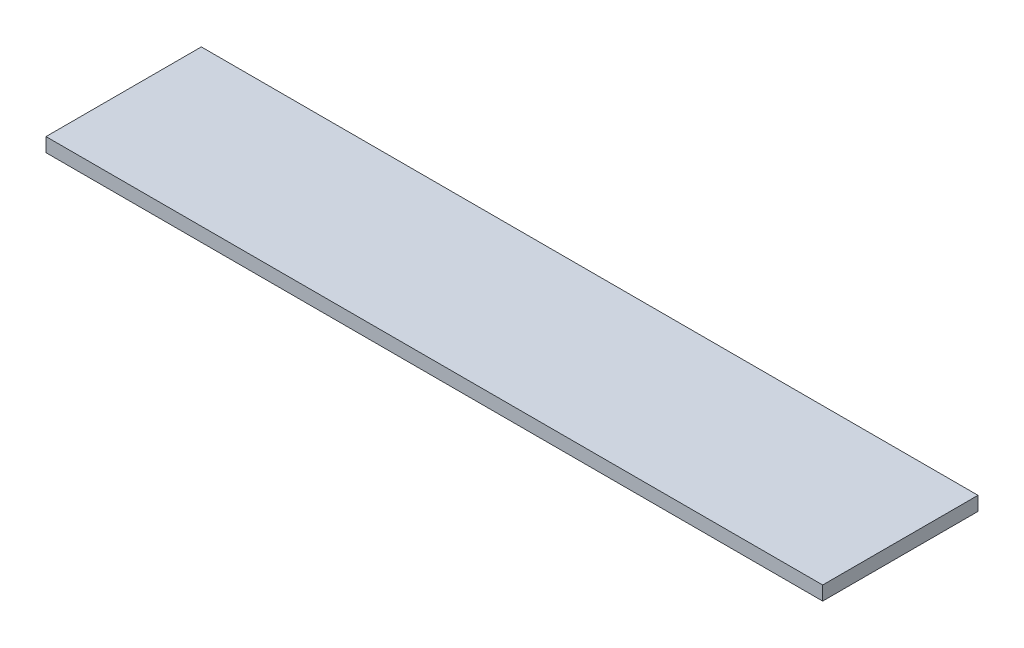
ISO-10303-21;
HEADER;
FILE_DESCRIPTION(('STEP AP214'),'2;1');
FILE_NAME('part.step','',(''),(''),'','','');
FILE_SCHEMA(('AUTOMOTIVE_DESIGN { 1 0 10303 214 1 1 1 1 }'));
ENDSEC;
DATA;
#1=APPLICATION_CONTEXT('core data for automotive mechanical design processes');
#2=APPLICATION_PROTOCOL_DEFINITION('international standard','automotive_design',2000,#1);
#3=PRODUCT_CONTEXT('',#1,'mechanical');
#4=PRODUCT('Part','Part','',(#3));
#5=PRODUCT_RELATED_PRODUCT_CATEGORY('part','',(#4));
#6=PRODUCT_DEFINITION_FORMATION('','',#4);
#7=PRODUCT_DEFINITION_CONTEXT('part definition',#1,'design');
#8=PRODUCT_DEFINITION('design','',#6,#7);
#9=PRODUCT_DEFINITION_SHAPE('','',#8);
#10=(LENGTH_UNIT() NAMED_UNIT(*) SI_UNIT(.MILLI.,.METRE.));
#11=(NAMED_UNIT(*) PLANE_ANGLE_UNIT() SI_UNIT($,.RADIAN.));
#12=(NAMED_UNIT(*) SI_UNIT($,.STERADIAN.) SOLID_ANGLE_UNIT());
#13=UNCERTAINTY_MEASURE_WITH_UNIT(LENGTH_MEASURE(1.E-05),#10,'distance_accuracy_value','');
#14=(GEOMETRIC_REPRESENTATION_CONTEXT(3) GLOBAL_UNCERTAINTY_ASSIGNED_CONTEXT((#13)) GLOBAL_UNIT_ASSIGNED_CONTEXT((#10,
#11,#12)) REPRESENTATION_CONTEXT('',''));
#15=CARTESIAN_POINT('',(0.,0.,0.));
#16=DIRECTION('',(0.,0.,1.));
#17=DIRECTION('',(1.,0.,0.));
#18=AXIS2_PLACEMENT_3D('',#15,#16,#17);
#19=CARTESIAN_POINT('',(-2500.,-45.0000000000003,500.));
#20=DIRECTION('',(1.,0.,0.));
#21=DIRECTION('',(0.,0.,-1.));
#22=AXIS2_PLACEMENT_3D('',#19,#20,#21);
#23=PLANE('',#22);
#24=DIRECTION('',(0.,-1.,0.));
#25=VECTOR('',#24,1.);
#26=CARTESIAN_POINT('',(-2500.,-45.0000000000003,-500.));
#27=LINE('',#26,#25);
#28=CARTESIAN_POINT('',(-2500.,44.9999999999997,-500.));
#29=VERTEX_POINT('',#28);
#30=CARTESIAN_POINT('',(-2500.,-45.0000000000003,-500.));
#31=VERTEX_POINT('',#30);
#32=EDGE_CURVE('E98',#29,#31,#27,.T.);
#33=ORIENTED_EDGE('',*,*,#32,.T.);
#34=DIRECTION('',(0.,0.,-1.));
#35=VECTOR('',#34,1.);
#36=CARTESIAN_POINT('',(-2500.,-45.0000000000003,500.));
#37=LINE('',#36,#35);
#38=CARTESIAN_POINT('',(-2500.,-45.0000000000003,500.));
#39=VERTEX_POINT('',#38);
#40=EDGE_CURVE('E11',#39,#31,#37,.T.);
#41=ORIENTED_EDGE('',*,*,#40,.F.);
#42=DIRECTION('',(0.,-1.,0.));
#43=VECTOR('',#42,1.);
#44=CARTESIAN_POINT('',(-2500.,-45.0000000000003,500.));
#45=LINE('',#44,#43);
#46=CARTESIAN_POINT('',(-2500.,44.9999999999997,500.));
#47=VERTEX_POINT('',#46);
#48=EDGE_CURVE('E86',#47,#39,#45,.T.);
#49=ORIENTED_EDGE('',*,*,#48,.F.);
#50=DIRECTION('',(0.,0.,-1.));
#51=VECTOR('',#50,1.);
#52=CARTESIAN_POINT('',(-2500.,44.9999999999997,500.));
#53=LINE('',#52,#51);
#54=EDGE_CURVE('E94',#47,#29,#53,.T.);
#55=ORIENTED_EDGE('',*,*,#54,.T.);
#56=EDGE_LOOP('',(#33,#41,#49,#55));
#57=FACE_BOUND('',#56,.T.);
#58=ADVANCED_FACE('F35',(#57),#23,.F.);
#59=CARTESIAN_POINT('',(2500.,-44.9999999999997,500.));
#60=DIRECTION('',(0.,1.,0.));
#61=DIRECTION('',(-1.,0.,0.));
#62=AXIS2_PLACEMENT_3D('',#59,#60,#61);
#63=PLANE('',#62);
#64=DIRECTION('',(1.,0.,0.));
#65=VECTOR('',#64,1.);
#66=CARTESIAN_POINT('',(2500.,-44.9999999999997,-500.));
#67=LINE('',#66,#65);
#68=CARTESIAN_POINT('',(2500.,-44.9999999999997,-500.));
#69=VERTEX_POINT('',#68);
#70=EDGE_CURVE('E90',#31,#69,#67,.T.);
#71=ORIENTED_EDGE('',*,*,#70,.T.);
#72=DIRECTION('',(0.,0.,-1.));
#73=VECTOR('',#72,1.);
#74=CARTESIAN_POINT('',(2500.,-44.9999999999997,500.));
#75=LINE('',#74,#73);
#76=CARTESIAN_POINT('',(2500.,-44.9999999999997,500.));
#77=VERTEX_POINT('',#76);
#78=EDGE_CURVE('E43',#77,#69,#75,.T.);
#79=ORIENTED_EDGE('',*,*,#78,.F.);
#80=DIRECTION('',(1.,0.,0.));
#81=VECTOR('',#80,1.);
#82=CARTESIAN_POINT('',(2500.,-44.9999999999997,500.));
#83=LINE('',#82,#81);
#84=EDGE_CURVE('E81',#39,#77,#83,.T.);
#85=ORIENTED_EDGE('',*,*,#84,.F.);
#86=ORIENTED_EDGE('',*,*,#40,.T.);
#87=EDGE_LOOP('',(#71,#79,#85,#86));
#88=FACE_BOUND('',#87,.T.);
#89=ADVANCED_FACE('F89',(#88),#63,.F.);
#90=CARTESIAN_POINT('',(2500.,-44.9999999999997,500.));
#91=DIRECTION('',(-1.,0.,0.));
#92=DIRECTION('',(0.,0.,1.));
#93=AXIS2_PLACEMENT_3D('',#90,#91,#92);
#94=PLANE('',#93);
#95=DIRECTION('',(0.,1.,0.));
#96=VECTOR('',#95,1.);
#97=CARTESIAN_POINT('',(2500.,-44.9999999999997,-500.));
#98=LINE('',#97,#96);
#99=CARTESIAN_POINT('',(2500.,45.0000000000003,-500.));
#100=VERTEX_POINT('',#99);
#101=EDGE_CURVE('E68',#69,#100,#98,.T.);
#102=ORIENTED_EDGE('',*,*,#101,.T.);
#103=DIRECTION('',(0.,0.,-1.));
#104=VECTOR('',#103,1.);
#105=CARTESIAN_POINT('',(2500.,45.0000000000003,500.));
#106=LINE('',#105,#104);
#107=CARTESIAN_POINT('',(2500.,45.0000000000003,500.));
#108=VERTEX_POINT('',#107);
#109=EDGE_CURVE('E91',#108,#100,#106,.T.);
#110=ORIENTED_EDGE('',*,*,#109,.F.);
#111=DIRECTION('',(0.,1.,0.));
#112=VECTOR('',#111,1.);
#113=CARTESIAN_POINT('',(2500.,-44.9999999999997,500.));
#114=LINE('',#113,#112);
#115=EDGE_CURVE('E84',#77,#108,#114,.T.);
#116=ORIENTED_EDGE('',*,*,#115,.F.);
#117=ORIENTED_EDGE('',*,*,#78,.T.);
#118=EDGE_LOOP('',(#102,#110,#116,#117));
#119=FACE_BOUND('',#118,.T.);
#120=ADVANCED_FACE('F92',(#119),#94,.F.);
#121=CARTESIAN_POINT('',(2500.,45.0000000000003,500.));
#122=DIRECTION('',(0.,-1.,0.));
#123=DIRECTION('',(1.,0.,0.));
#124=AXIS2_PLACEMENT_3D('',#121,#122,#123);
#125=PLANE('',#124);
#126=DIRECTION('',(-1.,0.,0.));
#127=VECTOR('',#126,1.);
#128=CARTESIAN_POINT('',(2500.,45.0000000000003,-500.));
#129=LINE('',#128,#127);
#130=EDGE_CURVE('E74',#100,#29,#129,.T.);
#131=ORIENTED_EDGE('',*,*,#130,.T.);
#132=ORIENTED_EDGE('',*,*,#54,.F.);
#133=DIRECTION('',(-1.,0.,0.));
#134=VECTOR('',#133,1.);
#135=CARTESIAN_POINT('',(2500.,45.0000000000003,500.));
#136=LINE('',#135,#134);
#137=EDGE_CURVE('E51',#108,#47,#136,.T.);
#138=ORIENTED_EDGE('',*,*,#137,.F.);
#139=ORIENTED_EDGE('',*,*,#109,.T.);
#140=EDGE_LOOP('',(#131,#132,#138,#139));
#141=FACE_BOUND('',#140,.T.);
#142=ADVANCED_FACE('F105',(#141),#125,.F.);
#143=CARTESIAN_POINT('',(0.,0.,500.));
#144=DIRECTION('',(0.,0.,1.));
#145=DIRECTION('',(1.,0.,0.));
#146=AXIS2_PLACEMENT_3D('',#143,#144,#145);
#147=PLANE('',#146);
#148=ORIENTED_EDGE('',*,*,#48,.T.);
#149=ORIENTED_EDGE('',*,*,#84,.T.);
#150=ORIENTED_EDGE('',*,*,#115,.T.);
#151=ORIENTED_EDGE('',*,*,#137,.T.);
#152=EDGE_LOOP('',(#148,#149,#150,#151));
#153=FACE_BOUND('',#152,.T.);
#154=ADVANCED_FACE('F82',(#153),#147,.T.);
#155=CARTESIAN_POINT('',(0.,0.,-500.));
#156=DIRECTION('',(0.,0.,1.));
#157=DIRECTION('',(1.,0.,0.));
#158=AXIS2_PLACEMENT_3D('',#155,#156,#157);
#159=PLANE('',#158);
#160=ORIENTED_EDGE('',*,*,#32,.F.);
#161=ORIENTED_EDGE('',*,*,#130,.F.);
#162=ORIENTED_EDGE('',*,*,#101,.F.);
#163=ORIENTED_EDGE('',*,*,#70,.F.);
#164=EDGE_LOOP('',(#160,#161,#162,#163));
#165=FACE_BOUND('',#164,.T.);
#166=ADVANCED_FACE('F108',(#165),#159,.F.);
#167=CLOSED_SHELL('',(#58,#89,#120,#142,#154,#166));
#168=MANIFOLD_SOLID_BREP('B2',#167);
#169=ADVANCED_BREP_SHAPE_REPRESENTATION('',(#18,#168),#14);
#170=SHAPE_DEFINITION_REPRESENTATION(#9,#169);
ENDSEC;
END-ISO-10303-21;
